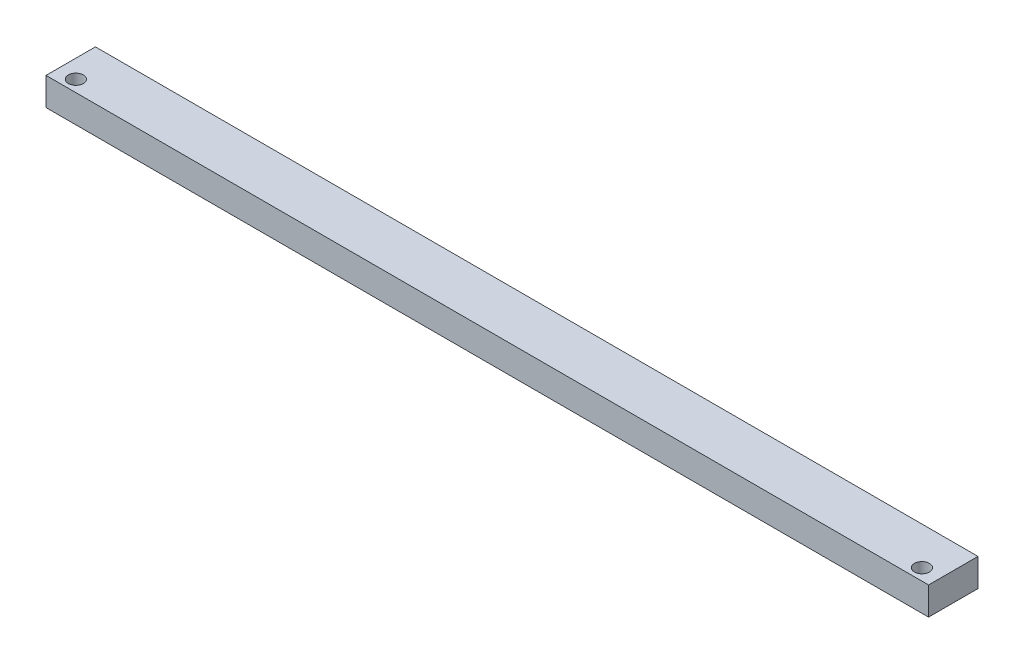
ISO-10303-21;
HEADER;
FILE_DESCRIPTION(('STEP AP214'),'2;1');
FILE_NAME('part.step','',(''),(''),'','','');
FILE_SCHEMA(('AUTOMOTIVE_DESIGN { 1 0 10303 214 1 1 1 1 }'));
ENDSEC;
DATA;
#1=APPLICATION_CONTEXT('core data for automotive mechanical design processes');
#2=APPLICATION_PROTOCOL_DEFINITION('international standard','automotive_design',2000,#1);
#3=PRODUCT_CONTEXT('',#1,'mechanical');
#4=PRODUCT('Part','Part','',(#3));
#5=PRODUCT_RELATED_PRODUCT_CATEGORY('part','',(#4));
#6=PRODUCT_DEFINITION_FORMATION('','',#4);
#7=PRODUCT_DEFINITION_CONTEXT('part definition',#1,'design');
#8=PRODUCT_DEFINITION('design','',#6,#7);
#9=PRODUCT_DEFINITION_SHAPE('','',#8);
#10=(LENGTH_UNIT() NAMED_UNIT(*) SI_UNIT(.MILLI.,.METRE.));
#11=(NAMED_UNIT(*) PLANE_ANGLE_UNIT() SI_UNIT($,.RADIAN.));
#12=(NAMED_UNIT(*) SI_UNIT($,.STERADIAN.) SOLID_ANGLE_UNIT());
#13=UNCERTAINTY_MEASURE_WITH_UNIT(LENGTH_MEASURE(1.E-05),#10,'distance_accuracy_value','');
#14=(GEOMETRIC_REPRESENTATION_CONTEXT(3) GLOBAL_UNCERTAINTY_ASSIGNED_CONTEXT((#13)) GLOBAL_UNIT_ASSIGNED_CONTEXT((#10,
#11,#12)) REPRESENTATION_CONTEXT('',''));
#15=CARTESIAN_POINT('',(0.,0.,0.));
#16=DIRECTION('',(0.,0.,1.));
#17=DIRECTION('',(1.,0.,0.));
#18=AXIS2_PLACEMENT_3D('',#15,#16,#17);
#19=CARTESIAN_POINT('',(0.,3.9624,0.));
#20=DIRECTION('',(0.,1.,0.));
#21=DIRECTION('',(0.,0.,1.));
#22=AXIS2_PLACEMENT_3D('',#19,#20,#21);
#23=PLANE('',#22);
#24=CARTESIAN_POINT('',(77.1473184,3.9624,-6.16447840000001));
#25=DIRECTION('',(0.,1.,0.));
#26=DIRECTION('',(0.,0.,1.));
#27=AXIS2_PLACEMENT_3D('',#24,#25,#26);
#28=CIRCLE('',#27,1.06680000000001);
#29=CARTESIAN_POINT('',(77.1473184,3.9624,-5.0976784));
#30=VERTEX_POINT('',#29);
#31=EDGE_CURVE('E114',#30,#30,#28,.T.);
#32=ORIENTED_EDGE('',*,*,#31,.F.);
#33=EDGE_LOOP('',(#32));
#34=FACE_BOUND('',#33,.T.);
#35=DIRECTION('',(0.,0.,1.));
#36=VECTOR('',#35,1.);
#37=CARTESIAN_POINT('',(-45.6362816,3.9624,-11.5365784));
#38=LINE('',#37,#36);
#39=CARTESIAN_POINT('',(-45.6362816,3.9624,-11.5365784));
#40=VERTEX_POINT('',#39);
#41=CARTESIAN_POINT('',(-45.6362816,3.9624,-4.51347840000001));
#42=VERTEX_POINT('',#41);
#43=EDGE_CURVE('E99',#40,#42,#38,.T.);
#44=ORIENTED_EDGE('',*,*,#43,.T.);
#45=DIRECTION('',(1.,0.,0.));
#46=VECTOR('',#45,1.);
#47=CARTESIAN_POINT('',(-45.6362816,3.9624,-4.51347840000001));
#48=LINE('',#47,#46);
#49=CARTESIAN_POINT('',(79.7381184,3.9624,-4.51347840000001));
#50=VERTEX_POINT('',#49);
#51=EDGE_CURVE('E94',#42,#50,#48,.T.);
#52=ORIENTED_EDGE('',*,*,#51,.T.);
#53=DIRECTION('',(0.,0.,-1.));
#54=VECTOR('',#53,1.);
#55=CARTESIAN_POINT('',(79.7381184,3.9624,-11.5365784));
#56=LINE('',#55,#54);
#57=CARTESIAN_POINT('',(79.7381184,3.9624,-11.5365784));
#58=VERTEX_POINT('',#57);
#59=EDGE_CURVE('E97',#50,#58,#56,.T.);
#60=ORIENTED_EDGE('',*,*,#59,.T.);
#61=DIRECTION('',(-1.,0.,0.));
#62=VECTOR('',#61,1.);
#63=CARTESIAN_POINT('',(-45.6362816,3.9624,-11.5365784));
#64=LINE('',#63,#62);
#65=EDGE_CURVE('E64',#58,#40,#64,.T.);
#66=ORIENTED_EDGE('',*,*,#65,.T.);
#67=EDGE_LOOP('',(#44,#52,#60,#66));
#68=FACE_BOUND('',#67,.T.);
#69=CARTESIAN_POINT('',(-43.0454816,3.9624,-6.16447839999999));
#70=DIRECTION('',(0.,1.,0.));
#71=DIRECTION('',(0.,0.,-1.));
#72=AXIS2_PLACEMENT_3D('',#69,#70,#71);
#73=CIRCLE('',#72,1.06680000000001);
#74=CARTESIAN_POINT('',(-43.0454816,3.9624,-7.2312784));
#75=VERTEX_POINT('',#74);
#76=EDGE_CURVE('E129',#75,#75,#73,.T.);
#77=ORIENTED_EDGE('',*,*,#76,.F.);
#78=EDGE_LOOP('',(#77));
#79=FACE_BOUND('',#78,.T.);
#80=ADVANCED_FACE('F47',(#34,#68,#79),#23,.T.);
#81=CARTESIAN_POINT('',(0.,0.,0.));
#82=DIRECTION('',(0.,1.,0.));
#83=DIRECTION('',(0.,0.,1.));
#84=AXIS2_PLACEMENT_3D('',#81,#82,#83);
#85=PLANE('',#84);
#86=DIRECTION('',(0.,0.,1.));
#87=VECTOR('',#86,1.);
#88=CARTESIAN_POINT('',(-45.6362816,0.,-11.5365784));
#89=LINE('',#88,#87);
#90=CARTESIAN_POINT('',(-45.6362816,0.,-11.5365784));
#91=VERTEX_POINT('',#90);
#92=CARTESIAN_POINT('',(-45.6362816,0.,-4.51347840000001));
#93=VERTEX_POINT('',#92);
#94=EDGE_CURVE('E111',#91,#93,#89,.T.);
#95=ORIENTED_EDGE('',*,*,#94,.F.);
#96=DIRECTION('',(-1.,0.,0.));
#97=VECTOR('',#96,1.);
#98=CARTESIAN_POINT('',(-45.6362816,0.,-11.5365784));
#99=LINE('',#98,#97);
#100=CARTESIAN_POINT('',(79.7381184,0.,-11.5365784));
#101=VERTEX_POINT('',#100);
#102=EDGE_CURVE('E87',#101,#91,#99,.T.);
#103=ORIENTED_EDGE('',*,*,#102,.F.);
#104=DIRECTION('',(0.,0.,-1.));
#105=VECTOR('',#104,1.);
#106=CARTESIAN_POINT('',(79.7381184,0.,-11.5365784));
#107=LINE('',#106,#105);
#108=CARTESIAN_POINT('',(79.7381184,0.,-4.51347840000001));
#109=VERTEX_POINT('',#108);
#110=EDGE_CURVE('E81',#109,#101,#107,.T.);
#111=ORIENTED_EDGE('',*,*,#110,.F.);
#112=DIRECTION('',(1.,0.,0.));
#113=VECTOR('',#112,1.);
#114=CARTESIAN_POINT('',(-45.6362816,0.,-4.51347840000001));
#115=LINE('',#114,#113);
#116=EDGE_CURVE('E103',#93,#109,#115,.T.);
#117=ORIENTED_EDGE('',*,*,#116,.F.);
#118=EDGE_LOOP('',(#95,#103,#111,#117));
#119=FACE_BOUND('',#118,.T.);
#120=CARTESIAN_POINT('',(77.1473184,0.,-6.16447840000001));
#121=DIRECTION('',(0.,1.,0.));
#122=DIRECTION('',(0.,0.,1.));
#123=AXIS2_PLACEMENT_3D('',#120,#121,#122);
#124=CIRCLE('',#123,1.06680000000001);
#125=CARTESIAN_POINT('',(77.1473184,0.,-5.0976784));
#126=VERTEX_POINT('',#125);
#127=EDGE_CURVE('E126',#126,#126,#124,.T.);
#128=ORIENTED_EDGE('',*,*,#127,.T.);
#129=EDGE_LOOP('',(#128));
#130=FACE_BOUND('',#129,.T.);
#131=CARTESIAN_POINT('',(-43.0454816,0.,-6.16447839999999));
#132=DIRECTION('',(0.,1.,0.));
#133=DIRECTION('',(0.,0.,-1.));
#134=AXIS2_PLACEMENT_3D('',#131,#132,#133);
#135=CIRCLE('',#134,1.06680000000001);
#136=CARTESIAN_POINT('',(-43.0454816,0.,-7.2312784));
#137=VERTEX_POINT('',#136);
#138=EDGE_CURVE('E132',#137,#137,#135,.T.);
#139=ORIENTED_EDGE('',*,*,#138,.T.);
#140=EDGE_LOOP('',(#139));
#141=FACE_BOUND('',#140,.T.);
#142=ADVANCED_FACE('F122',(#119,#130,#141),#85,.F.);
#143=CARTESIAN_POINT('',(-45.6362816,3.9624,-11.5365784));
#144=DIRECTION('',(1.,0.,0.));
#145=DIRECTION('',(0.,0.,-1.));
#146=AXIS2_PLACEMENT_3D('',#143,#144,#145);
#147=PLANE('',#146);
#148=ORIENTED_EDGE('',*,*,#94,.T.);
#149=DIRECTION('',(0.,-1.,0.));
#150=VECTOR('',#149,1.);
#151=CARTESIAN_POINT('',(-45.6362816,3.9624,-4.51347840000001));
#152=LINE('',#151,#150);
#153=EDGE_CURVE('E11',#42,#93,#152,.T.);
#154=ORIENTED_EDGE('',*,*,#153,.F.);
#155=ORIENTED_EDGE('',*,*,#43,.F.);
#156=DIRECTION('',(0.,-1.,0.));
#157=VECTOR('',#156,1.);
#158=CARTESIAN_POINT('',(-45.6362816,3.9624,-11.5365784));
#159=LINE('',#158,#157);
#160=EDGE_CURVE('E107',#40,#91,#159,.T.);
#161=ORIENTED_EDGE('',*,*,#160,.T.);
#162=EDGE_LOOP('',(#148,#154,#155,#161));
#163=FACE_BOUND('',#162,.T.);
#164=ADVANCED_FACE('F49',(#163),#147,.F.);
#165=CARTESIAN_POINT('',(-45.6362816,3.9624,-4.51347840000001));
#166=DIRECTION('',(0.,0.,-1.));
#167=DIRECTION('',(-1.,0.,0.));
#168=AXIS2_PLACEMENT_3D('',#165,#166,#167);
#169=PLANE('',#168);
#170=ORIENTED_EDGE('',*,*,#116,.T.);
#171=DIRECTION('',(0.,-1.,0.));
#172=VECTOR('',#171,1.);
#173=CARTESIAN_POINT('',(79.7381184,3.9624,-4.51347840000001));
#174=LINE('',#173,#172);
#175=EDGE_CURVE('E56',#50,#109,#174,.T.);
#176=ORIENTED_EDGE('',*,*,#175,.F.);
#177=ORIENTED_EDGE('',*,*,#51,.F.);
#178=ORIENTED_EDGE('',*,*,#153,.T.);
#179=EDGE_LOOP('',(#170,#176,#177,#178));
#180=FACE_BOUND('',#179,.T.);
#181=ADVANCED_FACE('F102',(#180),#169,.F.);
#182=CARTESIAN_POINT('',(79.7381184,3.9624,-11.5365784));
#183=DIRECTION('',(-1.,0.,0.));
#184=DIRECTION('',(0.,0.,1.));
#185=AXIS2_PLACEMENT_3D('',#182,#183,#184);
#186=PLANE('',#185);
#187=ORIENTED_EDGE('',*,*,#110,.T.);
#188=DIRECTION('',(0.,-1.,0.));
#189=VECTOR('',#188,1.);
#190=CARTESIAN_POINT('',(79.7381184,3.9624,-11.5365784));
#191=LINE('',#190,#189);
#192=EDGE_CURVE('E104',#58,#101,#191,.T.);
#193=ORIENTED_EDGE('',*,*,#192,.F.);
#194=ORIENTED_EDGE('',*,*,#59,.F.);
#195=ORIENTED_EDGE('',*,*,#175,.T.);
#196=EDGE_LOOP('',(#187,#193,#194,#195));
#197=FACE_BOUND('',#196,.T.);
#198=ADVANCED_FACE('F105',(#197),#186,.F.);
#199=CARTESIAN_POINT('',(-45.6362816,3.9624,-11.5365784));
#200=DIRECTION('',(0.,0.,1.));
#201=DIRECTION('',(1.,0.,0.));
#202=AXIS2_PLACEMENT_3D('',#199,#200,#201);
#203=PLANE('',#202);
#204=ORIENTED_EDGE('',*,*,#102,.T.);
#205=ORIENTED_EDGE('',*,*,#160,.F.);
#206=ORIENTED_EDGE('',*,*,#65,.F.);
#207=ORIENTED_EDGE('',*,*,#192,.T.);
#208=EDGE_LOOP('',(#204,#205,#206,#207));
#209=FACE_BOUND('',#208,.T.);
#210=ADVANCED_FACE('F119',(#209),#203,.F.);
#211=CARTESIAN_POINT('',(77.1473184,3.9624,-6.16447840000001));
#212=DIRECTION('',(0.,-1.,0.));
#213=DIRECTION('',(0.,0.,-1.));
#214=AXIS2_PLACEMENT_3D('',#211,#212,#213);
#215=CYLINDRICAL_SURFACE('',#214,1.06680000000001);
#216=ORIENTED_EDGE('',*,*,#31,.T.);
#217=EDGE_LOOP('',(#216));
#218=FACE_BOUND('',#217,.T.);
#219=ORIENTED_EDGE('',*,*,#127,.F.);
#220=EDGE_LOOP('',(#219));
#221=FACE_BOUND('',#220,.T.);
#222=ADVANCED_FACE('F149',(#218,#221),#215,.F.);
#223=CARTESIAN_POINT('',(-43.0454816,3.9624,-6.16447839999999));
#224=DIRECTION('',(0.,-1.,0.));
#225=DIRECTION('',(0.,0.,-1.));
#226=AXIS2_PLACEMENT_3D('',#223,#224,#225);
#227=CYLINDRICAL_SURFACE('',#226,1.06680000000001);
#228=ORIENTED_EDGE('',*,*,#76,.T.);
#229=EDGE_LOOP('',(#228));
#230=FACE_BOUND('',#229,.T.);
#231=ORIENTED_EDGE('',*,*,#138,.F.);
#232=EDGE_LOOP('',(#231));
#233=FACE_BOUND('',#232,.T.);
#234=ADVANCED_FACE('F138',(#230,#233),#227,.F.);
#235=CLOSED_SHELL('',(#80,#142,#164,#181,#198,#210,#222,#234));
#236=MANIFOLD_SOLID_BREP('B2',#235);
#237=ADVANCED_BREP_SHAPE_REPRESENTATION('',(#18,#236),#14);
#238=SHAPE_DEFINITION_REPRESENTATION(#9,#237);
ENDSEC;
END-ISO-10303-21;
